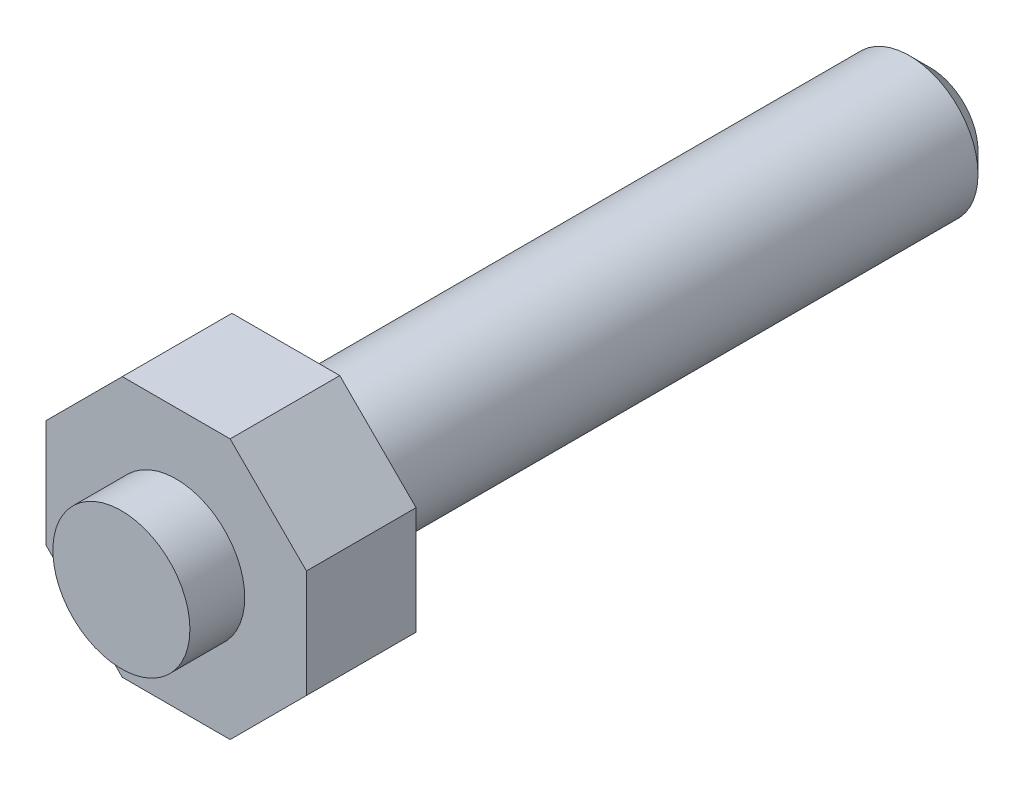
ISO-10303-21;
HEADER;
FILE_DESCRIPTION(('STEP AP214'),'2;1');
FILE_NAME('part.step','',(''),(''),'','','');
FILE_SCHEMA(('AUTOMOTIVE_DESIGN { 1 0 10303 214 1 1 1 1 }'));
ENDSEC;
DATA;
#1=APPLICATION_CONTEXT('core data for automotive mechanical design processes');
#2=APPLICATION_PROTOCOL_DEFINITION('international standard','automotive_design',2000,#1);
#3=PRODUCT_CONTEXT('',#1,'mechanical');
#4=PRODUCT('Part','Part','',(#3));
#5=PRODUCT_RELATED_PRODUCT_CATEGORY('part','',(#4));
#6=PRODUCT_DEFINITION_FORMATION('','',#4);
#7=PRODUCT_DEFINITION_CONTEXT('part definition',#1,'design');
#8=PRODUCT_DEFINITION('design','',#6,#7);
#9=PRODUCT_DEFINITION_SHAPE('','',#8);
#10=(LENGTH_UNIT() NAMED_UNIT(*) SI_UNIT(.MILLI.,.METRE.));
#11=(NAMED_UNIT(*) PLANE_ANGLE_UNIT() SI_UNIT($,.RADIAN.));
#12=(NAMED_UNIT(*) SI_UNIT($,.STERADIAN.) SOLID_ANGLE_UNIT());
#13=UNCERTAINTY_MEASURE_WITH_UNIT(LENGTH_MEASURE(1.E-05),#10,'distance_accuracy_value','');
#14=(GEOMETRIC_REPRESENTATION_CONTEXT(3) GLOBAL_UNCERTAINTY_ASSIGNED_CONTEXT((#13)) GLOBAL_UNIT_ASSIGNED_CONTEXT((#10,
#11,#12)) REPRESENTATION_CONTEXT('',''));
#15=CARTESIAN_POINT('',(0.,0.,0.));
#16=DIRECTION('',(0.,0.,1.));
#17=DIRECTION('',(1.,0.,0.));
#18=AXIS2_PLACEMENT_3D('',#15,#16,#17);
#19=CARTESIAN_POINT('',(5.,0.,47.));
#20=DIRECTION('',(0.,0.,1.));
#21=DIRECTION('',(1.,0.,0.));
#22=AXIS2_PLACEMENT_3D('',#19,#20,#21);
#23=PLANE('',#22);
#24=CARTESIAN_POINT('',(0.,0.,47.));
#25=DIRECTION('',(0.,0.,1.));
#26=DIRECTION('',(1.,0.,0.));
#27=AXIS2_PLACEMENT_3D('',#24,#25,#26);
#28=CIRCLE('',#27,5.);
#29=CARTESIAN_POINT('',(5.,0.,47.));
#30=VERTEX_POINT('',#29);
#31=EDGE_CURVE('E144',#30,#30,#28,.T.);
#32=ORIENTED_EDGE('',*,*,#31,.T.);
#33=EDGE_LOOP('',(#32));
#34=FACE_BOUND('',#33,.T.);
#35=DIRECTION('',(-0.707106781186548,-0.707106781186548,0.));
#36=VECTOR('',#35,1.);
#37=CARTESIAN_POINT('',(9.5,-3.9350288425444,47.));
#38=LINE('',#37,#36);
#39=CARTESIAN_POINT('',(9.5,-3.9350288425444,47.));
#40=VERTEX_POINT('',#39);
#41=CARTESIAN_POINT('',(3.9350288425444,-9.5,47.));
#42=VERTEX_POINT('',#41);
#43=EDGE_CURVE('E101',#40,#42,#38,.T.);
#44=ORIENTED_EDGE('',*,*,#43,.T.);
#45=DIRECTION('',(1.,0.,0.));
#46=VECTOR('',#45,1.);
#47=CARTESIAN_POINT('',(-3.9350288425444,-9.5,47.));
#48=LINE('',#47,#46);
#49=CARTESIAN_POINT('',(-3.9350288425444,-9.5,47.));
#50=VERTEX_POINT('',#49);
#51=EDGE_CURVE('E99',#50,#42,#48,.T.);
#52=ORIENTED_EDGE('',*,*,#51,.F.);
#53=DIRECTION('',(0.707106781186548,-0.707106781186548,0.));
#54=VECTOR('',#53,1.);
#55=CARTESIAN_POINT('',(-9.5,-3.9350288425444,47.));
#56=LINE('',#55,#54);
#57=CARTESIAN_POINT('',(-9.5,-3.9350288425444,47.));
#58=VERTEX_POINT('',#57);
#59=EDGE_CURVE('E29',#58,#50,#56,.T.);
#60=ORIENTED_EDGE('',*,*,#59,.F.);
#61=DIRECTION('',(0.,-1.,0.));
#62=VECTOR('',#61,1.);
#63=CARTESIAN_POINT('',(-9.5,3.9350288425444,47.));
#64=LINE('',#63,#62);
#65=CARTESIAN_POINT('',(-9.5,3.9350288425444,47.));
#66=VERTEX_POINT('',#65);
#67=EDGE_CURVE('E89',#66,#58,#64,.T.);
#68=ORIENTED_EDGE('',*,*,#67,.F.);
#69=DIRECTION('',(0.707106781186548,0.707106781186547,0.));
#70=VECTOR('',#69,1.);
#71=CARTESIAN_POINT('',(-9.5,3.9350288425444,47.));
#72=LINE('',#71,#70);
#73=CARTESIAN_POINT('',(-3.9350288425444,9.5,47.));
#74=VERTEX_POINT('',#73);
#75=EDGE_CURVE('E94',#66,#74,#72,.T.);
#76=ORIENTED_EDGE('',*,*,#75,.T.);
#77=DIRECTION('',(1.,0.,0.));
#78=VECTOR('',#77,1.);
#79=CARTESIAN_POINT('',(-3.9350288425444,9.5,47.));
#80=LINE('',#79,#78);
#81=CARTESIAN_POINT('',(3.9350288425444,9.5,47.));
#82=VERTEX_POINT('',#81);
#83=EDGE_CURVE('E233',#74,#82,#80,.T.);
#84=ORIENTED_EDGE('',*,*,#83,.T.);
#85=DIRECTION('',(0.707106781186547,-0.707106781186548,0.));
#86=VECTOR('',#85,1.);
#87=CARTESIAN_POINT('',(3.9350288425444,9.5,47.));
#88=LINE('',#87,#86);
#89=CARTESIAN_POINT('',(9.5,3.9350288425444,47.));
#90=VERTEX_POINT('',#89);
#91=EDGE_CURVE('E231',#82,#90,#88,.T.);
#92=ORIENTED_EDGE('',*,*,#91,.T.);
#93=DIRECTION('',(0.,-1.,0.));
#94=VECTOR('',#93,1.);
#95=CARTESIAN_POINT('',(9.5,3.9350288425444,47.));
#96=LINE('',#95,#94);
#97=EDGE_CURVE('E126',#90,#40,#96,.T.);
#98=ORIENTED_EDGE('',*,*,#97,.T.);
#99=EDGE_LOOP('',(#44,#52,#60,#68,#76,#84,#92,#98));
#100=FACE_BOUND('',#99,.T.);
#101=ADVANCED_FACE('F14',(#34,#100),#23,.F.);
#102=CARTESIAN_POINT('',(0.,0.,0.));
#103=DIRECTION('',(0.,0.,1.));
#104=DIRECTION('',(1.,0.,0.));
#105=AXIS2_PLACEMENT_3D('',#102,#103,#104);
#106=PLANE('',#105);
#107=CARTESIAN_POINT('',(0.,0.,0.));
#108=DIRECTION('',(0.,0.,1.));
#109=DIRECTION('',(1.,0.,0.));
#110=AXIS2_PLACEMENT_3D('',#107,#108,#109);
#111=CIRCLE('',#110,3.5);
#112=CARTESIAN_POINT('',(3.5,0.,0.));
#113=VERTEX_POINT('',#112);
#114=EDGE_CURVE('E9',#113,#113,#111,.F.);
#115=ORIENTED_EDGE('',*,*,#114,.T.);
#116=EDGE_LOOP('',(#115));
#117=FACE_BOUND('',#116,.T.);
#118=ADVANCED_FACE('F165',(#117),#106,.F.);
#119=CARTESIAN_POINT('',(0.,0.,80.));
#120=DIRECTION('',(0.,0.,1.));
#121=DIRECTION('',(1.,0.,0.));
#122=AXIS2_PLACEMENT_3D('',#119,#120,#121);
#123=CYLINDRICAL_SURFACE('',#122,5.);
#124=CARTESIAN_POINT('',(0.,0.,1.49999999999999));
#125=DIRECTION('',(0.,0.,1.));
#126=DIRECTION('',(1.,0.,0.));
#127=AXIS2_PLACEMENT_3D('',#124,#125,#126);
#128=CIRCLE('',#127,5.);
#129=CARTESIAN_POINT('',(5.,0.,1.49999999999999));
#130=VERTEX_POINT('',#129);
#131=EDGE_CURVE('E22',#130,#130,#128,.T.);
#132=ORIENTED_EDGE('',*,*,#131,.T.);
#133=EDGE_LOOP('',(#132));
#134=FACE_BOUND('',#133,.T.);
#135=ORIENTED_EDGE('',*,*,#31,.F.);
#136=EDGE_LOOP('',(#135));
#137=FACE_BOUND('',#136,.T.);
#138=ADVANCED_FACE('F149',(#134,#137),#123,.T.);
#139=CARTESIAN_POINT('',(9.5,-3.9350288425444,55.));
#140=DIRECTION('',(0.707106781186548,-0.707106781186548,0.));
#141=DIRECTION('',(0.707106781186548,0.707106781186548,0.));
#142=AXIS2_PLACEMENT_3D('',#139,#140,#141);
#143=PLANE('',#142);
#144=DIRECTION('',(0.,0.,-1.));
#145=VECTOR('',#144,1.);
#146=CARTESIAN_POINT('',(9.5,-3.9350288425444,55.));
#147=LINE('',#146,#145);
#148=CARTESIAN_POINT('',(9.5,-3.9350288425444,55.));
#149=VERTEX_POINT('',#148);
#150=EDGE_CURVE('E136',#149,#40,#147,.T.);
#151=ORIENTED_EDGE('',*,*,#150,.F.);
#152=DIRECTION('',(-0.707106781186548,-0.707106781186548,0.));
#153=VECTOR('',#152,1.);
#154=CARTESIAN_POINT('',(9.5,-3.9350288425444,55.));
#155=LINE('',#154,#153);
#156=CARTESIAN_POINT('',(3.9350288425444,-9.5,55.));
#157=VERTEX_POINT('',#156);
#158=EDGE_CURVE('E37',#149,#157,#155,.T.);
#159=ORIENTED_EDGE('',*,*,#158,.T.);
#160=DIRECTION('',(0.,0.,-1.));
#161=VECTOR('',#160,1.);
#162=CARTESIAN_POINT('',(3.9350288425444,-9.5,55.));
#163=LINE('',#162,#161);
#164=EDGE_CURVE('E109',#157,#42,#163,.T.);
#165=ORIENTED_EDGE('',*,*,#164,.T.);
#166=ORIENTED_EDGE('',*,*,#43,.F.);
#167=EDGE_LOOP('',(#151,#159,#165,#166));
#168=FACE_BOUND('',#167,.T.);
#169=ADVANCED_FACE('F176',(#168),#143,.T.);
#170=CARTESIAN_POINT('',(9.5,3.9350288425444,55.));
#171=DIRECTION('',(1.,0.,0.));
#172=DIRECTION('',(0.,1.,0.));
#173=AXIS2_PLACEMENT_3D('',#170,#171,#172);
#174=PLANE('',#173);
#175=DIRECTION('',(0.,0.,-1.));
#176=VECTOR('',#175,1.);
#177=CARTESIAN_POINT('',(9.5,3.9350288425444,55.));
#178=LINE('',#177,#176);
#179=CARTESIAN_POINT('',(9.5,3.9350288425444,55.));
#180=VERTEX_POINT('',#179);
#181=EDGE_CURVE('E134',#180,#90,#178,.T.);
#182=ORIENTED_EDGE('',*,*,#181,.F.);
#183=DIRECTION('',(0.,-1.,0.));
#184=VECTOR('',#183,1.);
#185=CARTESIAN_POINT('',(9.5,3.9350288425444,55.));
#186=LINE('',#185,#184);
#187=EDGE_CURVE('E106',#180,#149,#186,.T.);
#188=ORIENTED_EDGE('',*,*,#187,.T.);
#189=ORIENTED_EDGE('',*,*,#150,.T.);
#190=ORIENTED_EDGE('',*,*,#97,.F.);
#191=EDGE_LOOP('',(#182,#188,#189,#190));
#192=FACE_BOUND('',#191,.T.);
#193=ADVANCED_FACE('F181',(#192),#174,.T.);
#194=CARTESIAN_POINT('',(3.9350288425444,9.5,55.));
#195=DIRECTION('',(0.707106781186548,0.707106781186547,0.));
#196=DIRECTION('',(-0.707106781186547,0.707106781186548,0.));
#197=AXIS2_PLACEMENT_3D('',#194,#195,#196);
#198=PLANE('',#197);
#199=DIRECTION('',(0.,0.,-1.));
#200=VECTOR('',#199,1.);
#201=CARTESIAN_POINT('',(3.9350288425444,9.5,55.));
#202=LINE('',#201,#200);
#203=CARTESIAN_POINT('',(3.9350288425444,9.5,55.));
#204=VERTEX_POINT('',#203);
#205=EDGE_CURVE('E132',#204,#82,#202,.T.);
#206=ORIENTED_EDGE('',*,*,#205,.F.);
#207=DIRECTION('',(0.707106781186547,-0.707106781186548,0.));
#208=VECTOR('',#207,1.);
#209=CARTESIAN_POINT('',(3.9350288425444,9.5,55.));
#210=LINE('',#209,#208);
#211=EDGE_CURVE('E110',#204,#180,#210,.T.);
#212=ORIENTED_EDGE('',*,*,#211,.T.);
#213=ORIENTED_EDGE('',*,*,#181,.T.);
#214=ORIENTED_EDGE('',*,*,#91,.F.);
#215=EDGE_LOOP('',(#206,#212,#213,#214));
#216=FACE_BOUND('',#215,.T.);
#217=ADVANCED_FACE('F187',(#216),#198,.T.);
#218=CARTESIAN_POINT('',(-3.9350288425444,9.5,55.));
#219=DIRECTION('',(0.,1.,0.));
#220=DIRECTION('',(0.,0.,1.));
#221=AXIS2_PLACEMENT_3D('',#218,#219,#220);
#222=PLANE('',#221);
#223=DIRECTION('',(0.,0.,-1.));
#224=VECTOR('',#223,1.);
#225=CARTESIAN_POINT('',(-3.9350288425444,9.5,55.));
#226=LINE('',#225,#224);
#227=CARTESIAN_POINT('',(-3.9350288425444,9.5,55.));
#228=VERTEX_POINT('',#227);
#229=EDGE_CURVE('E130',#228,#74,#226,.T.);
#230=ORIENTED_EDGE('',*,*,#229,.F.);
#231=DIRECTION('',(1.,0.,0.));
#232=VECTOR('',#231,1.);
#233=CARTESIAN_POINT('',(-3.9350288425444,9.5,55.));
#234=LINE('',#233,#232);
#235=EDGE_CURVE('E113',#228,#204,#234,.T.);
#236=ORIENTED_EDGE('',*,*,#235,.T.);
#237=ORIENTED_EDGE('',*,*,#205,.T.);
#238=ORIENTED_EDGE('',*,*,#83,.F.);
#239=EDGE_LOOP('',(#230,#236,#237,#238));
#240=FACE_BOUND('',#239,.T.);
#241=ADVANCED_FACE('F203',(#240),#222,.T.);
#242=CARTESIAN_POINT('',(-9.5,3.9350288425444,55.));
#243=DIRECTION('',(-0.707106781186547,0.707106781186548,0.));
#244=DIRECTION('',(-0.707106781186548,-0.707106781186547,0.));
#245=AXIS2_PLACEMENT_3D('',#242,#243,#244);
#246=PLANE('',#245);
#247=DIRECTION('',(0.,0.,-1.));
#248=VECTOR('',#247,1.);
#249=CARTESIAN_POINT('',(-9.5,3.9350288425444,55.));
#250=LINE('',#249,#248);
#251=CARTESIAN_POINT('',(-9.5,3.9350288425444,55.));
#252=VERTEX_POINT('',#251);
#253=EDGE_CURVE('E85',#252,#66,#250,.T.);
#254=ORIENTED_EDGE('',*,*,#253,.F.);
#255=DIRECTION('',(0.707106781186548,0.707106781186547,0.));
#256=VECTOR('',#255,1.);
#257=CARTESIAN_POINT('',(-9.5,3.9350288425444,55.));
#258=LINE('',#257,#256);
#259=EDGE_CURVE('E116',#252,#228,#258,.T.);
#260=ORIENTED_EDGE('',*,*,#259,.T.);
#261=ORIENTED_EDGE('',*,*,#229,.T.);
#262=ORIENTED_EDGE('',*,*,#75,.F.);
#263=EDGE_LOOP('',(#254,#260,#261,#262));
#264=FACE_BOUND('',#263,.T.);
#265=ADVANCED_FACE('F200',(#264),#246,.T.);
#266=CARTESIAN_POINT('',(-9.5,3.9350288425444,55.));
#267=DIRECTION('',(1.,0.,0.));
#268=DIRECTION('',(0.,1.,0.));
#269=AXIS2_PLACEMENT_3D('',#266,#267,#268);
#270=PLANE('',#269);
#271=DIRECTION('',(0.,0.,-1.));
#272=VECTOR('',#271,1.);
#273=CARTESIAN_POINT('',(-9.5,-3.9350288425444,55.));
#274=LINE('',#273,#272);
#275=CARTESIAN_POINT('',(-9.5,-3.9350288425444,55.));
#276=VERTEX_POINT('',#275);
#277=EDGE_CURVE('E77',#276,#58,#274,.T.);
#278=ORIENTED_EDGE('',*,*,#277,.F.);
#279=DIRECTION('',(0.,-1.,0.));
#280=VECTOR('',#279,1.);
#281=CARTESIAN_POINT('',(-9.5,3.9350288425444,55.));
#282=LINE('',#281,#280);
#283=EDGE_CURVE('E119',#252,#276,#282,.T.);
#284=ORIENTED_EDGE('',*,*,#283,.F.);
#285=ORIENTED_EDGE('',*,*,#253,.T.);
#286=ORIENTED_EDGE('',*,*,#67,.T.);
#287=EDGE_LOOP('',(#278,#284,#285,#286));
#288=FACE_BOUND('',#287,.T.);
#289=ADVANCED_FACE('F90',(#288),#270,.F.);
#290=CARTESIAN_POINT('',(-9.5,-3.9350288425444,55.));
#291=DIRECTION('',(0.707106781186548,0.707106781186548,0.));
#292=DIRECTION('',(-0.707106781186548,0.707106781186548,0.));
#293=AXIS2_PLACEMENT_3D('',#290,#291,#292);
#294=PLANE('',#293);
#295=DIRECTION('',(0.,0.,-1.));
#296=VECTOR('',#295,1.);
#297=CARTESIAN_POINT('',(-3.9350288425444,-9.5,55.));
#298=LINE('',#297,#296);
#299=CARTESIAN_POINT('',(-3.9350288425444,-9.5,55.));
#300=VERTEX_POINT('',#299);
#301=EDGE_CURVE('E86',#300,#50,#298,.T.);
#302=ORIENTED_EDGE('',*,*,#301,.F.);
#303=DIRECTION('',(0.707106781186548,-0.707106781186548,0.));
#304=VECTOR('',#303,1.);
#305=CARTESIAN_POINT('',(-9.5,-3.9350288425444,55.));
#306=LINE('',#305,#304);
#307=EDGE_CURVE('E81',#276,#300,#306,.T.);
#308=ORIENTED_EDGE('',*,*,#307,.F.);
#309=ORIENTED_EDGE('',*,*,#277,.T.);
#310=ORIENTED_EDGE('',*,*,#59,.T.);
#311=EDGE_LOOP('',(#302,#308,#309,#310));
#312=FACE_BOUND('',#311,.T.);
#313=ADVANCED_FACE('F79',(#312),#294,.F.);
#314=CARTESIAN_POINT('',(-3.9350288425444,-9.5,55.));
#315=DIRECTION('',(0.,1.,0.));
#316=DIRECTION('',(0.,0.,1.));
#317=AXIS2_PLACEMENT_3D('',#314,#315,#316);
#318=PLANE('',#317);
#319=DIRECTION('',(1.,0.,0.));
#320=VECTOR('',#319,1.);
#321=CARTESIAN_POINT('',(-3.9350288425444,-9.5,55.));
#322=LINE('',#321,#320);
#323=EDGE_CURVE('E122',#300,#157,#322,.T.);
#324=ORIENTED_EDGE('',*,*,#323,.F.);
#325=ORIENTED_EDGE('',*,*,#301,.T.);
#326=ORIENTED_EDGE('',*,*,#51,.T.);
#327=ORIENTED_EDGE('',*,*,#164,.F.);
#328=EDGE_LOOP('',(#324,#325,#326,#327));
#329=FACE_BOUND('',#328,.T.);
#330=ADVANCED_FACE('F191',(#329),#318,.F.);
#331=CARTESIAN_POINT('',(5.,0.,59.));
#332=DIRECTION('',(0.,0.,-1.));
#333=DIRECTION('',(-1.,0.,0.));
#334=AXIS2_PLACEMENT_3D('',#331,#332,#333);
#335=PLANE('',#334);
#336=CARTESIAN_POINT('',(0.,0.,59.));
#337=DIRECTION('',(0.,0.,1.));
#338=DIRECTION('',(1.,0.,0.));
#339=AXIS2_PLACEMENT_3D('',#336,#337,#338);
#340=CIRCLE('',#339,5.);
#341=CARTESIAN_POINT('',(5.,0.,59.));
#342=VERTEX_POINT('',#341);
#343=EDGE_CURVE('E138',#342,#342,#340,.T.);
#344=ORIENTED_EDGE('',*,*,#343,.T.);
#345=EDGE_LOOP('',(#344));
#346=FACE_BOUND('',#345,.T.);
#347=ADVANCED_FACE('F194',(#346),#335,.F.);
#348=CARTESIAN_POINT('',(0.,0.,80.));
#349=DIRECTION('',(0.,0.,1.));
#350=DIRECTION('',(1.,0.,0.));
#351=AXIS2_PLACEMENT_3D('',#348,#349,#350);
#352=CYLINDRICAL_SURFACE('',#351,5.);
#353=ORIENTED_EDGE('',*,*,#343,.F.);
#354=EDGE_LOOP('',(#353));
#355=FACE_BOUND('',#354,.T.);
#356=CARTESIAN_POINT('',(0.,0.,55.));
#357=DIRECTION('',(0.,0.,1.));
#358=DIRECTION('',(1.,0.,0.));
#359=AXIS2_PLACEMENT_3D('',#356,#357,#358);
#360=CIRCLE('',#359,5.);
#361=CARTESIAN_POINT('',(5.,0.,55.));
#362=VERTEX_POINT('',#361);
#363=EDGE_CURVE('E141',#362,#362,#360,.T.);
#364=ORIENTED_EDGE('',*,*,#363,.T.);
#365=EDGE_LOOP('',(#364));
#366=FACE_BOUND('',#365,.T.);
#367=ADVANCED_FACE('F160',(#355,#366),#352,.T.);
#368=CARTESIAN_POINT('',(11.,0.,55.));
#369=DIRECTION('',(0.,0.,-1.));
#370=DIRECTION('',(-1.,0.,0.));
#371=AXIS2_PLACEMENT_3D('',#368,#369,#370);
#372=PLANE('',#371);
#373=ORIENTED_EDGE('',*,*,#363,.F.);
#374=EDGE_LOOP('',(#373));
#375=FACE_BOUND('',#374,.T.);
#376=ORIENTED_EDGE('',*,*,#158,.F.);
#377=ORIENTED_EDGE('',*,*,#187,.F.);
#378=ORIENTED_EDGE('',*,*,#211,.F.);
#379=ORIENTED_EDGE('',*,*,#235,.F.);
#380=ORIENTED_EDGE('',*,*,#259,.F.);
#381=ORIENTED_EDGE('',*,*,#283,.T.);
#382=ORIENTED_EDGE('',*,*,#307,.T.);
#383=ORIENTED_EDGE('',*,*,#323,.T.);
#384=EDGE_LOOP('',(#376,#377,#378,#379,#380,#381,#382,#383));
#385=FACE_BOUND('',#384,.T.);
#386=ADVANCED_FACE('F153',(#375,#385),#372,.F.);
#387=CARTESIAN_POINT('',(0.,0.,1.49999999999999));
#388=DIRECTION('',(0.,0.,1.));
#389=DIRECTION('',(1.,0.,0.));
#390=AXIS2_PLACEMENT_3D('',#387,#388,#389);
#391=CONICAL_SURFACE('',#390,5.,0.785398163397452);
#392=ORIENTED_EDGE('',*,*,#114,.F.);
#393=EDGE_LOOP('',(#392));
#394=FACE_BOUND('',#393,.T.);
#395=ORIENTED_EDGE('',*,*,#131,.F.);
#396=EDGE_LOOP('',(#395));
#397=FACE_BOUND('',#396,.T.);
#398=ADVANCED_FACE('F16',(#394,#397),#391,.T.);
#399=CLOSED_SHELL('',(#101,#118,#138,#169,#193,#217,#241,#265,#289,#313,#330,#347,#367,#386,#398));
#400=MANIFOLD_SOLID_BREP('B1',#399);
#401=ADVANCED_BREP_SHAPE_REPRESENTATION('',(#18,#400),#14);
#402=SHAPE_DEFINITION_REPRESENTATION(#9,#401);
ENDSEC;
END-ISO-10303-21;
